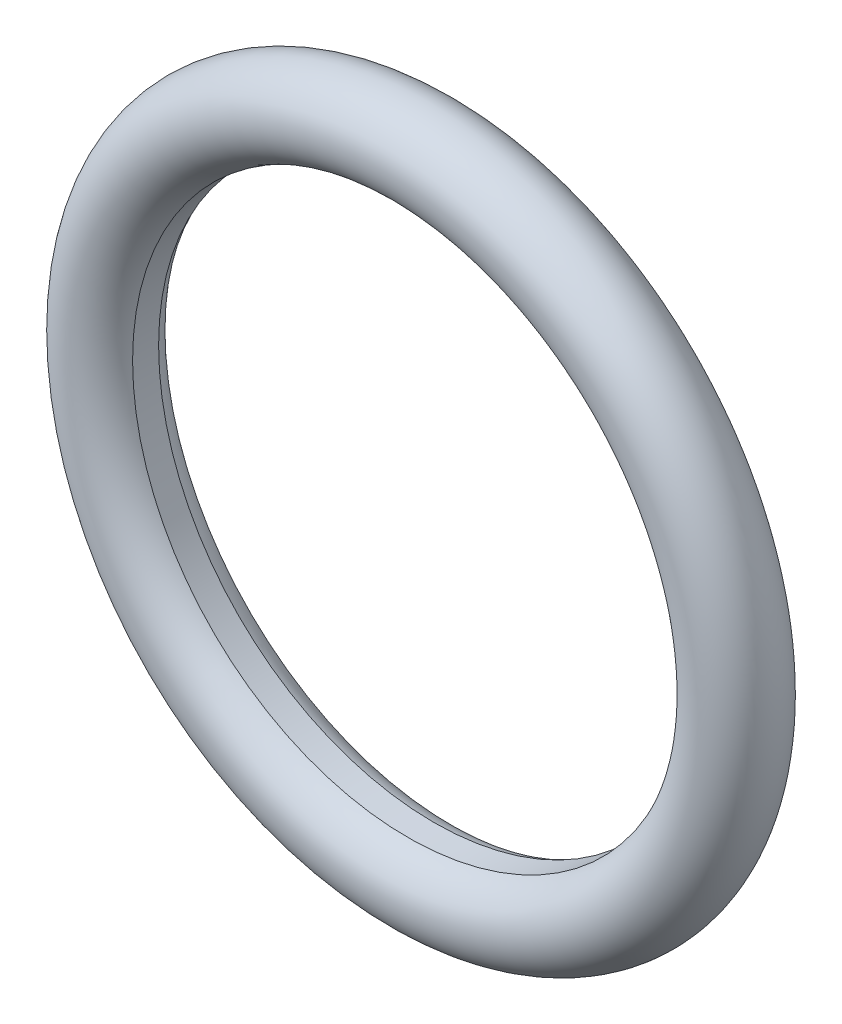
from build123d import *

# Parameters (mm, degrees)
SKETCH2_R               = 1.31
CUT_EXTRUDE1_DEPTH      = 16.865084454
CUT_EXTRUDE1_DEPTH_BACK = 16.865084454
SKETCH3_R               = 8.625


with BuildPart() as part:
    # Base-Sweep: sweep along a path in Sketch1
    with BuildLine(Plane.XY) as base_sweep_path:
        CenterArc((0, 0), 9.87, 0, 360)
    # Sketch2 → Base-Sweep (sweep)
    with BuildSketch(Plane(origin=(0, 0, 0), x_dir=(0, 0, -1), z_dir=(1, 0, 0))):
        with Locations((0, 9.87)):
            Circle(SKETCH2_R)
    sweep(path=base_sweep_path.line)

    # Sketch3 → Cut-Extrude1 (cut, two sides: drawn at the far end of the back side and taken through both)
    with BuildSketch(Plane.XY.offset(-CUT_EXTRUDE1_DEPTH_BACK)):
        with Locations(Location((0, 0, 0), (0, 0, 180))):
            Circle(SKETCH3_R)
    extrude(amount=CUT_EXTRUDE1_DEPTH + CUT_EXTRUDE1_DEPTH_BACK, mode=Mode.SUBTRACT)


solid = part.part
